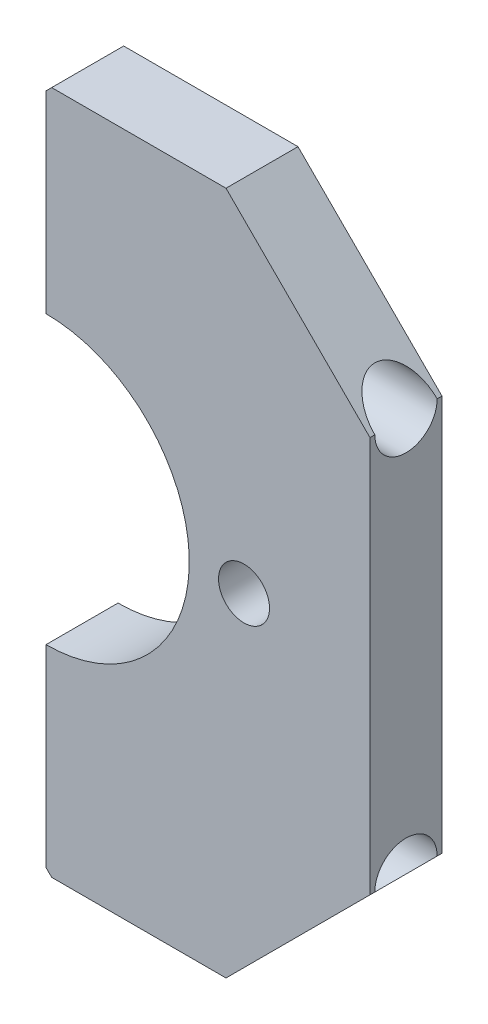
ISO-10303-21;
HEADER;
FILE_DESCRIPTION(('STEP AP214'),'2;1');
FILE_NAME('part.step','',(''),(''),'','','');
FILE_SCHEMA(('AUTOMOTIVE_DESIGN { 1 0 10303 214 1 1 1 1 }'));
ENDSEC;
DATA;
#1=APPLICATION_CONTEXT('core data for automotive mechanical design processes');
#2=APPLICATION_PROTOCOL_DEFINITION('international standard','automotive_design',2000,#1);
#3=PRODUCT_CONTEXT('',#1,'mechanical');
#4=PRODUCT('Part','Part','',(#3));
#5=PRODUCT_RELATED_PRODUCT_CATEGORY('part','',(#4));
#6=PRODUCT_DEFINITION_FORMATION('','',#4);
#7=PRODUCT_DEFINITION_CONTEXT('part definition',#1,'design');
#8=PRODUCT_DEFINITION('design','',#6,#7);
#9=PRODUCT_DEFINITION_SHAPE('','',#8);
#10=(LENGTH_UNIT() NAMED_UNIT(*) SI_UNIT(.MILLI.,.METRE.));
#11=(NAMED_UNIT(*) PLANE_ANGLE_UNIT() SI_UNIT($,.RADIAN.));
#12=(NAMED_UNIT(*) SI_UNIT($,.STERADIAN.) SOLID_ANGLE_UNIT());
#13=UNCERTAINTY_MEASURE_WITH_UNIT(LENGTH_MEASURE(1.E-05),#10,'distance_accuracy_value','');
#14=(GEOMETRIC_REPRESENTATION_CONTEXT(3) GLOBAL_UNCERTAINTY_ASSIGNED_CONTEXT((#13)) GLOBAL_UNIT_ASSIGNED_CONTEXT((#10,
#11,#12)) REPRESENTATION_CONTEXT('',''));
#15=CARTESIAN_POINT('',(0.,0.,0.));
#16=DIRECTION('',(0.,0.,1.));
#17=DIRECTION('',(1.,0.,0.));
#18=AXIS2_PLACEMENT_3D('',#15,#16,#17);
#19=CARTESIAN_POINT('',(57.15,-60.325,12.7));
#20=DIRECTION('',(-1.,0.,0.));
#21=DIRECTION('',(0.,0.,1.));
#22=AXIS2_PLACEMENT_3D('',#19,#20,#21);
#23=PLANE('',#22);
#24=DIRECTION('',(0.,0.,1.));
#25=VECTOR('',#24,1.);
#26=CARTESIAN_POINT('',(57.15,34.9249999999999,12.7));
#27=LINE('',#26,#25);
#28=CARTESIAN_POINT('',(57.15,34.9249999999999,0.));
#29=VERTEX_POINT('',#28);
#30=CARTESIAN_POINT('',(57.15,34.9249999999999,0.850899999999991));
#31=VERTEX_POINT('',#30);
#32=EDGE_CURVE('E139',#29,#31,#27,.T.);
#33=ORIENTED_EDGE('',*,*,#32,.T.);
#34=CARTESIAN_POINT('',(57.15,34.925,6.35));
#35=DIRECTION('',(1.,0.,0.));
#36=DIRECTION('',(0.,0.,-1.));
#37=AXIS2_PLACEMENT_3D('',#34,#35,#36);
#38=CIRCLE('',#37,5.49910000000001);
#39=CARTESIAN_POINT('',(57.15,34.9249999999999,11.8491));
#40=VERTEX_POINT('',#39);
#41=EDGE_CURVE('E126',#40,#31,#38,.T.);
#42=ORIENTED_EDGE('',*,*,#41,.F.);
#43=CARTESIAN_POINT('',(57.15,34.9249999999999,12.7));
#44=VERTEX_POINT('',#43);
#45=EDGE_CURVE('E136',#40,#44,#27,.T.);
#46=ORIENTED_EDGE('',*,*,#45,.T.);
#47=DIRECTION('',(0.,1.,0.));
#48=VECTOR('',#47,1.);
#49=CARTESIAN_POINT('',(57.15,-60.325,12.7));
#50=LINE('',#49,#48);
#51=CARTESIAN_POINT('',(57.15,-34.9250000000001,12.7));
#52=VERTEX_POINT('',#51);
#53=EDGE_CURVE('E196',#52,#44,#50,.T.);
#54=ORIENTED_EDGE('',*,*,#53,.F.);
#55=DIRECTION('',(0.,0.,-1.));
#56=VECTOR('',#55,1.);
#57=CARTESIAN_POINT('',(57.15,-34.925,12.7));
#58=LINE('',#57,#56);
#59=CARTESIAN_POINT('',(57.15,-34.925,11.8491));
#60=VERTEX_POINT('',#59);
#61=EDGE_CURVE('E146',#52,#60,#58,.T.);
#62=ORIENTED_EDGE('',*,*,#61,.T.);
#63=CARTESIAN_POINT('',(57.15,-34.925,6.35));
#64=DIRECTION('',(1.,0.,0.));
#65=DIRECTION('',(0.,0.,-1.));
#66=AXIS2_PLACEMENT_3D('',#63,#64,#65);
#67=CIRCLE('',#66,5.49910000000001);
#68=CARTESIAN_POINT('',(57.15,-34.925,0.85089999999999));
#69=VERTEX_POINT('',#68);
#70=EDGE_CURVE('E215',#69,#60,#67,.T.);
#71=ORIENTED_EDGE('',*,*,#70,.F.);
#72=CARTESIAN_POINT('',(57.15,-34.925,0.));
#73=VERTEX_POINT('',#72);
#74=EDGE_CURVE('E150',#69,#73,#58,.T.);
#75=ORIENTED_EDGE('',*,*,#74,.T.);
#76=DIRECTION('',(0.,1.,0.));
#77=VECTOR('',#76,1.);
#78=CARTESIAN_POINT('',(57.15,-60.325,0.));
#79=LINE('',#78,#77);
#80=EDGE_CURVE('E214',#73,#29,#79,.T.);
#81=ORIENTED_EDGE('',*,*,#80,.T.);
#82=EDGE_LOOP('',(#33,#42,#46,#54,#62,#71,#75,#81));
#83=FACE_BOUND('',#82,.T.);
#84=ADVANCED_FACE('F34',(#83),#23,.F.);
#85=CARTESIAN_POINT('',(0.,-60.325,12.7));
#86=DIRECTION('',(1.,0.,0.));
#87=DIRECTION('',(0.,0.,-1.));
#88=AXIS2_PLACEMENT_3D('',#85,#86,#87);
#89=PLANE('',#88);
#90=CARTESIAN_POINT('',(0.,34.925,6.35));
#91=DIRECTION('',(1.,0.,0.));
#92=DIRECTION('',(0.,0.,-1.));
#93=AXIS2_PLACEMENT_3D('',#90,#91,#92);
#94=CIRCLE('',#93,3.30200000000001);
#95=CARTESIAN_POINT('',(0.,34.925,3.04799999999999));
#96=VERTEX_POINT('',#95);
#97=EDGE_CURVE('E248',#96,#96,#94,.T.);
#98=ORIENTED_EDGE('',*,*,#97,.T.);
#99=EDGE_LOOP('',(#98));
#100=FACE_BOUND('',#99,.T.);
#101=DIRECTION('',(0.,-1.,0.));
#102=VECTOR('',#101,1.);
#103=CARTESIAN_POINT('',(0.,-60.325,12.7));
#104=LINE('',#103,#102);
#105=CARTESIAN_POINT('',(0.,59.325,12.7));
#106=VERTEX_POINT('',#105);
#107=CARTESIAN_POINT('',(0.,25.273,12.7));
#108=VERTEX_POINT('',#107);
#109=EDGE_CURVE('E183',#106,#108,#104,.T.);
#110=ORIENTED_EDGE('',*,*,#109,.F.);
#111=DIRECTION('',(0.,0.,-1.));
#112=VECTOR('',#111,1.);
#113=CARTESIAN_POINT('',(0.,59.325,12.7));
#114=LINE('',#113,#112);
#115=CARTESIAN_POINT('',(0.,59.325,0.));
#116=VERTEX_POINT('',#115);
#117=EDGE_CURVE('E42',#106,#116,#114,.T.);
#118=ORIENTED_EDGE('',*,*,#117,.T.);
#119=DIRECTION('',(0.,-1.,0.));
#120=VECTOR('',#119,1.);
#121=CARTESIAN_POINT('',(0.,-60.325,0.));
#122=LINE('',#121,#120);
#123=CARTESIAN_POINT('',(0.,25.273,0.));
#124=VERTEX_POINT('',#123);
#125=EDGE_CURVE('E181',#116,#124,#122,.T.);
#126=ORIENTED_EDGE('',*,*,#125,.T.);
#127=DIRECTION('',(0.,0.,1.));
#128=VECTOR('',#127,1.);
#129=CARTESIAN_POINT('',(0.,25.273,0.));
#130=LINE('',#129,#128);
#131=EDGE_CURVE('E162',#124,#108,#130,.T.);
#132=ORIENTED_EDGE('',*,*,#131,.T.);
#133=EDGE_LOOP('',(#110,#118,#126,#132));
#134=FACE_BOUND('',#133,.T.);
#135=ADVANCED_FACE('F180',(#100,#134),#89,.F.);
#136=CARTESIAN_POINT('',(57.15,60.325,12.7));
#137=DIRECTION('',(0.,0.,1.));
#138=DIRECTION('',(1.,0.,0.));
#139=AXIS2_PLACEMENT_3D('',#136,#137,#138);
#140=PLANE('',#139);
#141=CARTESIAN_POINT('',(0.,-25.273,12.7));
#142=VERTEX_POINT('',#141);
#143=CARTESIAN_POINT('',(0.,-59.325,12.7));
#144=VERTEX_POINT('',#143);
#145=EDGE_CURVE('E228',#142,#144,#104,.T.);
#146=ORIENTED_EDGE('',*,*,#145,.T.);
#147=DIRECTION('',(-0.707106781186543,0.707106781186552,0.));
#148=VECTOR('',#147,1.);
#149=CARTESIAN_POINT('',(-31.2500000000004,-28.0749999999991,12.7));
#150=LINE('',#149,#148);
#151=CARTESIAN_POINT('',(0.999999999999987,-60.325,12.7));
#152=VERTEX_POINT('',#151);
#153=EDGE_CURVE('E175',#144,#152,#150,.F.);
#154=ORIENTED_EDGE('',*,*,#153,.T.);
#155=DIRECTION('',(1.,0.,0.));
#156=VECTOR('',#155,1.);
#157=CARTESIAN_POINT('',(57.15,-60.325,12.7));
#158=LINE('',#157,#156);
#159=CARTESIAN_POINT('',(31.7499999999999,-60.325,12.7));
#160=VERTEX_POINT('',#159);
#161=EDGE_CURVE('E207',#152,#160,#158,.T.);
#162=ORIENTED_EDGE('',*,*,#161,.T.);
#163=DIRECTION('',(-0.707106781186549,-0.707106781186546,0.));
#164=VECTOR('',#163,1.);
#165=CARTESIAN_POINT('',(104.775,12.6999999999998,12.7));
#166=LINE('',#165,#164);
#167=EDGE_CURVE('E148',#160,#52,#166,.F.);
#168=ORIENTED_EDGE('',*,*,#167,.T.);
#169=ORIENTED_EDGE('',*,*,#53,.T.);
#170=DIRECTION('',(0.707106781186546,-0.707106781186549,0.));
#171=VECTOR('',#170,1.);
#172=CARTESIAN_POINT('',(44.45,47.625,12.7));
#173=LINE('',#172,#171);
#174=CARTESIAN_POINT('',(31.75,60.325,12.7));
#175=VERTEX_POINT('',#174);
#176=EDGE_CURVE('E145',#44,#175,#173,.F.);
#177=ORIENTED_EDGE('',*,*,#176,.T.);
#178=DIRECTION('',(-1.,0.,0.));
#179=VECTOR('',#178,1.);
#180=CARTESIAN_POINT('',(57.15,60.325,12.7));
#181=LINE('',#180,#179);
#182=CARTESIAN_POINT('',(0.999999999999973,60.325,12.7));
#183=VERTEX_POINT('',#182);
#184=EDGE_CURVE('E229',#175,#183,#181,.T.);
#185=ORIENTED_EDGE('',*,*,#184,.T.);
#186=DIRECTION('',(0.707106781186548,0.707106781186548,0.));
#187=VECTOR('',#186,1.);
#188=CARTESIAN_POINT('',(29.075,88.4,12.7));
#189=LINE('',#188,#187);
#190=EDGE_CURVE('E49',#183,#106,#189,.F.);
#191=ORIENTED_EDGE('',*,*,#190,.T.);
#192=ORIENTED_EDGE('',*,*,#109,.T.);
#193=CARTESIAN_POINT('',(0.,0.,12.7));
#194=DIRECTION('',(0.,0.,1.));
#195=DIRECTION('',(1.,0.,0.));
#196=AXIS2_PLACEMENT_3D('',#193,#194,#195);
#197=CIRCLE('',#196,25.273);
#198=EDGE_CURVE('E234',#142,#108,#197,.T.);
#199=ORIENTED_EDGE('',*,*,#198,.F.);
#200=EDGE_LOOP('',(#146,#154,#162,#168,#169,#177,#185,#191,#192,#199));
#201=FACE_BOUND('',#200,.T.);
#202=CARTESIAN_POINT('',(34.925,0.,12.7));
#203=DIRECTION('',(0.,0.,1.));
#204=DIRECTION('',(1.,0.,0.));
#205=AXIS2_PLACEMENT_3D('',#202,#203,#204);
#206=CIRCLE('',#205,4.4958);
#207=CARTESIAN_POINT('',(39.4208,0.,12.7));
#208=VERTEX_POINT('',#207);
#209=EDGE_CURVE('E221',#208,#208,#206,.T.);
#210=ORIENTED_EDGE('',*,*,#209,.F.);
#211=EDGE_LOOP('',(#210));
#212=FACE_BOUND('',#211,.T.);
#213=ADVANCED_FACE('F274',(#201,#212),#140,.T.);
#214=CARTESIAN_POINT('',(57.15,60.325,0.));
#215=DIRECTION('',(0.,0.,1.));
#216=DIRECTION('',(1.,0.,0.));
#217=AXIS2_PLACEMENT_3D('',#214,#215,#216);
#218=PLANE('',#217);
#219=DIRECTION('',(1.,0.,0.));
#220=VECTOR('',#219,1.);
#221=CARTESIAN_POINT('',(57.15,-60.325,0.));
#222=LINE('',#221,#220);
#223=CARTESIAN_POINT('',(0.999999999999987,-60.325,0.));
#224=VERTEX_POINT('',#223);
#225=CARTESIAN_POINT('',(31.7499999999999,-60.325,0.));
#226=VERTEX_POINT('',#225);
#227=EDGE_CURVE('E193',#224,#226,#222,.T.);
#228=ORIENTED_EDGE('',*,*,#227,.F.);
#229=DIRECTION('',(0.707106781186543,-0.707106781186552,0.));
#230=VECTOR('',#229,1.);
#231=CARTESIAN_POINT('',(0.999999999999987,-60.325,0.));
#232=LINE('',#231,#230);
#233=CARTESIAN_POINT('',(0.,-59.325,0.));
#234=VERTEX_POINT('',#233);
#235=EDGE_CURVE('E170',#224,#234,#232,.F.);
#236=ORIENTED_EDGE('',*,*,#235,.T.);
#237=CARTESIAN_POINT('',(0.,-25.273,0.));
#238=VERTEX_POINT('',#237);
#239=EDGE_CURVE('E194',#238,#234,#122,.T.);
#240=ORIENTED_EDGE('',*,*,#239,.F.);
#241=CARTESIAN_POINT('',(0.,0.,0.));
#242=DIRECTION('',(0.,0.,1.));
#243=DIRECTION('',(1.,0.,0.));
#244=AXIS2_PLACEMENT_3D('',#241,#242,#243);
#245=CIRCLE('',#244,25.273);
#246=EDGE_CURVE('E192',#238,#124,#245,.T.);
#247=ORIENTED_EDGE('',*,*,#246,.T.);
#248=ORIENTED_EDGE('',*,*,#125,.F.);
#249=DIRECTION('',(-0.707106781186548,-0.707106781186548,0.));
#250=VECTOR('',#249,1.);
#251=CARTESIAN_POINT('',(0.,59.325,0.));
#252=LINE('',#251,#250);
#253=CARTESIAN_POINT('',(0.999999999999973,60.325,0.));
#254=VERTEX_POINT('',#253);
#255=EDGE_CURVE('E168',#116,#254,#252,.F.);
#256=ORIENTED_EDGE('',*,*,#255,.T.);
#257=DIRECTION('',(-1.,0.,0.));
#258=VECTOR('',#257,1.);
#259=CARTESIAN_POINT('',(57.15,60.325,0.));
#260=LINE('',#259,#258);
#261=CARTESIAN_POINT('',(31.75,60.325,0.));
#262=VERTEX_POINT('',#261);
#263=EDGE_CURVE('E199',#262,#254,#260,.T.);
#264=ORIENTED_EDGE('',*,*,#263,.F.);
#265=DIRECTION('',(-0.707106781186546,0.707106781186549,0.));
#266=VECTOR('',#265,1.);
#267=CARTESIAN_POINT('',(31.75,60.325,0.));
#268=LINE('',#267,#266);
#269=EDGE_CURVE('E209',#262,#29,#268,.F.);
#270=ORIENTED_EDGE('',*,*,#269,.T.);
#271=ORIENTED_EDGE('',*,*,#80,.F.);
#272=DIRECTION('',(0.707106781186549,0.707106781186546,0.));
#273=VECTOR('',#272,1.);
#274=CARTESIAN_POINT('',(57.15,-34.925,0.));
#275=LINE('',#274,#273);
#276=EDGE_CURVE('E206',#73,#226,#275,.F.);
#277=ORIENTED_EDGE('',*,*,#276,.T.);
#278=EDGE_LOOP('',(#228,#236,#240,#247,#248,#256,#264,#270,#271,#277));
#279=FACE_BOUND('',#278,.T.);
#280=CARTESIAN_POINT('',(34.925,0.,0.));
#281=DIRECTION('',(0.,0.,1.));
#282=DIRECTION('',(1.,0.,0.));
#283=AXIS2_PLACEMENT_3D('',#280,#281,#282);
#284=CIRCLE('',#283,4.4958);
#285=CARTESIAN_POINT('',(39.4208,0.,0.));
#286=VERTEX_POINT('',#285);
#287=EDGE_CURVE('E223',#286,#286,#284,.T.);
#288=ORIENTED_EDGE('',*,*,#287,.T.);
#289=EDGE_LOOP('',(#288));
#290=FACE_BOUND('',#289,.T.);
#291=ADVANCED_FACE('F188',(#279,#290),#218,.F.);
#292=CARTESIAN_POINT('',(57.15,60.325,12.7));
#293=DIRECTION('',(0.,-1.,0.));
#294=DIRECTION('',(1.,0.,0.));
#295=AXIS2_PLACEMENT_3D('',#292,#293,#294);
#296=PLANE('',#295);
#297=ORIENTED_EDGE('',*,*,#263,.T.);
#298=DIRECTION('',(0.,0.,1.));
#299=VECTOR('',#298,1.);
#300=CARTESIAN_POINT('',(0.999999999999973,60.325,12.7));
#301=LINE('',#300,#299);
#302=EDGE_CURVE('E11',#254,#183,#301,.T.);
#303=ORIENTED_EDGE('',*,*,#302,.T.);
#304=ORIENTED_EDGE('',*,*,#184,.F.);
#305=DIRECTION('',(0.,0.,-1.));
#306=VECTOR('',#305,1.);
#307=CARTESIAN_POINT('',(31.75,60.325,12.7));
#308=LINE('',#307,#306);
#309=EDGE_CURVE('E203',#175,#262,#308,.T.);
#310=ORIENTED_EDGE('',*,*,#309,.T.);
#311=EDGE_LOOP('',(#297,#303,#304,#310));
#312=FACE_BOUND('',#311,.T.);
#313=ADVANCED_FACE('F280',(#312),#296,.F.);
#314=CARTESIAN_POINT('',(0.,-34.925,6.35));
#315=DIRECTION('',(1.,0.,0.));
#316=DIRECTION('',(0.,0.,-1.));
#317=AXIS2_PLACEMENT_3D('',#314,#315,#316);
#318=CIRCLE('',#317,3.30200000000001);
#319=CARTESIAN_POINT('',(0.,-34.925,3.04799999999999));
#320=VERTEX_POINT('',#319);
#321=EDGE_CURVE('E237',#320,#320,#318,.T.);
#322=ORIENTED_EDGE('',*,*,#321,.T.);
#323=EDGE_LOOP('',(#322));
#324=FACE_BOUND('',#323,.T.);
#325=ORIENTED_EDGE('',*,*,#239,.T.);
#326=DIRECTION('',(0.,0.,1.));
#327=VECTOR('',#326,1.);
#328=CARTESIAN_POINT('',(0.,-59.325,12.7));
#329=LINE('',#328,#327);
#330=EDGE_CURVE('E172',#234,#144,#329,.T.);
#331=ORIENTED_EDGE('',*,*,#330,.T.);
#332=ORIENTED_EDGE('',*,*,#145,.F.);
#333=DIRECTION('',(0.,0.,1.));
#334=VECTOR('',#333,1.);
#335=CARTESIAN_POINT('',(0.,-25.273,0.));
#336=LINE('',#335,#334);
#337=EDGE_CURVE('E159',#142,#238,#336,.F.);
#338=ORIENTED_EDGE('',*,*,#337,.T.);
#339=EDGE_LOOP('',(#325,#331,#332,#338));
#340=FACE_BOUND('',#339,.T.);
#341=ADVANCED_FACE('F277',(#324,#340),#89,.F.);
#342=CARTESIAN_POINT('',(57.15,-60.325,12.7));
#343=DIRECTION('',(0.,1.,0.));
#344=DIRECTION('',(-1.,0.,0.));
#345=AXIS2_PLACEMENT_3D('',#342,#343,#344);
#346=PLANE('',#345);
#347=ORIENTED_EDGE('',*,*,#161,.F.);
#348=DIRECTION('',(0.,0.,-1.));
#349=VECTOR('',#348,1.);
#350=CARTESIAN_POINT('',(0.999999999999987,-60.325,12.7));
#351=LINE('',#350,#349);
#352=EDGE_CURVE('E131',#152,#224,#351,.T.);
#353=ORIENTED_EDGE('',*,*,#352,.T.);
#354=ORIENTED_EDGE('',*,*,#227,.T.);
#355=DIRECTION('',(0.,0.,1.));
#356=VECTOR('',#355,1.);
#357=CARTESIAN_POINT('',(31.7499999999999,-60.325,12.7));
#358=LINE('',#357,#356);
#359=EDGE_CURVE('E156',#226,#160,#358,.T.);
#360=ORIENTED_EDGE('',*,*,#359,.T.);
#361=EDGE_LOOP('',(#347,#353,#354,#360));
#362=FACE_BOUND('',#361,.T.);
#363=ADVANCED_FACE('F302',(#362),#346,.F.);
#364=CARTESIAN_POINT('',(34.925,0.,12.7));
#365=DIRECTION('',(0.,0.,-1.));
#366=DIRECTION('',(-1.,0.,0.));
#367=AXIS2_PLACEMENT_3D('',#364,#365,#366);
#368=CYLINDRICAL_SURFACE('',#367,4.4958);
#369=ORIENTED_EDGE('',*,*,#209,.T.);
#370=EDGE_LOOP('',(#369));
#371=FACE_BOUND('',#370,.T.);
#372=ORIENTED_EDGE('',*,*,#287,.F.);
#373=EDGE_LOOP('',(#372));
#374=FACE_BOUND('',#373,.T.);
#375=ADVANCED_FACE('F283',(#371,#374),#368,.F.);
#376=CARTESIAN_POINT('',(31.75,60.325,12.7));
#377=DIRECTION('',(-0.707106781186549,-0.707106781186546,0.));
#378=DIRECTION('',(0.707106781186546,-0.707106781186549,0.));
#379=AXIS2_PLACEMENT_3D('',#376,#377,#378);
#380=PLANE('',#379);
#381=CARTESIAN_POINT('',(57.1499999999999,34.925,6.35));
#382=DIRECTION('',(-0.707106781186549,-0.707106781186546,0.));
#383=DIRECTION('',(0.707106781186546,-0.707106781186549,0.));
#384=AXIS2_PLACEMENT_3D('',#381,#382,#383);
#385=ELLIPSE('',#384,7.77690180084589,5.49910000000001);
#386=EDGE_CURVE('E122',#31,#40,#385,.F.);
#387=ORIENTED_EDGE('',*,*,#386,.F.);
#388=ORIENTED_EDGE('',*,*,#32,.F.);
#389=ORIENTED_EDGE('',*,*,#269,.F.);
#390=ORIENTED_EDGE('',*,*,#309,.F.);
#391=ORIENTED_EDGE('',*,*,#176,.F.);
#392=ORIENTED_EDGE('',*,*,#45,.F.);
#393=EDGE_LOOP('',(#387,#388,#389,#390,#391,#392));
#394=FACE_BOUND('',#393,.T.);
#395=ADVANCED_FACE('F143',(#394),#380,.F.);
#396=CARTESIAN_POINT('',(57.15,-34.925,12.7));
#397=DIRECTION('',(-0.707106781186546,0.707106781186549,0.));
#398=DIRECTION('',(-0.707106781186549,-0.707106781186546,0.));
#399=AXIS2_PLACEMENT_3D('',#396,#397,#398);
#400=PLANE('',#399);
#401=CARTESIAN_POINT('',(57.15,-34.925,6.35));
#402=DIRECTION('',(-0.707106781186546,0.707106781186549,0.));
#403=DIRECTION('',(0.707106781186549,0.707106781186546,0.));
#404=AXIS2_PLACEMENT_3D('',#401,#402,#403);
#405=ELLIPSE('',#404,7.77690180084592,5.49910000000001);
#406=EDGE_CURVE('E132',#60,#69,#405,.F.);
#407=ORIENTED_EDGE('',*,*,#406,.F.);
#408=ORIENTED_EDGE('',*,*,#61,.F.);
#409=ORIENTED_EDGE('',*,*,#167,.F.);
#410=ORIENTED_EDGE('',*,*,#359,.F.);
#411=ORIENTED_EDGE('',*,*,#276,.F.);
#412=ORIENTED_EDGE('',*,*,#74,.F.);
#413=EDGE_LOOP('',(#407,#408,#409,#410,#411,#412));
#414=FACE_BOUND('',#413,.T.);
#415=ADVANCED_FACE('F219',(#414),#400,.F.);
#416=CARTESIAN_POINT('',(0.,0.,0.));
#417=DIRECTION('',(0.,0.,1.));
#418=DIRECTION('',(1.,0.,0.));
#419=AXIS2_PLACEMENT_3D('',#416,#417,#418);
#420=CYLINDRICAL_SURFACE('',#419,25.273);
#421=ORIENTED_EDGE('',*,*,#246,.F.);
#422=ORIENTED_EDGE('',*,*,#337,.F.);
#423=ORIENTED_EDGE('',*,*,#198,.T.);
#424=ORIENTED_EDGE('',*,*,#131,.F.);
#425=EDGE_LOOP('',(#421,#422,#423,#424));
#426=FACE_BOUND('',#425,.T.);
#427=ADVANCED_FACE('F285',(#426),#420,.F.);
#428=CARTESIAN_POINT('',(57.15,-34.925,6.35));
#429=DIRECTION('',(1.,0.,0.));
#430=DIRECTION('',(0.,0.,-1.));
#431=AXIS2_PLACEMENT_3D('',#428,#429,#430);
#432=CYLINDRICAL_SURFACE('',#431,3.30200000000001);
#433=ORIENTED_EDGE('',*,*,#321,.F.);
#434=EDGE_LOOP('',(#433));
#435=FACE_BOUND('',#434,.T.);
#436=CARTESIAN_POINT('',(30.226,-34.925,6.35));
#437=DIRECTION('',(1.,0.,0.));
#438=DIRECTION('',(0.,0.,-1.));
#439=AXIS2_PLACEMENT_3D('',#436,#437,#438);
#440=CIRCLE('',#439,3.30200000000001);
#441=CARTESIAN_POINT('',(30.226,-34.925,3.04799999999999));
#442=VERTEX_POINT('',#441);
#443=EDGE_CURVE('E241',#442,#442,#440,.T.);
#444=ORIENTED_EDGE('',*,*,#443,.T.);
#445=EDGE_LOOP('',(#444));
#446=FACE_BOUND('',#445,.T.);
#447=ADVANCED_FACE('F289',(#435,#446),#432,.F.);
#448=CARTESIAN_POINT('',(30.226,-31.623,6.35));
#449=DIRECTION('',(-1.,0.,0.));
#450=DIRECTION('',(0.,0.,1.));
#451=AXIS2_PLACEMENT_3D('',#448,#449,#450);
#452=PLANE('',#451);
#453=ORIENTED_EDGE('',*,*,#443,.F.);
#454=EDGE_LOOP('',(#453));
#455=FACE_BOUND('',#454,.T.);
#456=CARTESIAN_POINT('',(30.226,-34.925,6.35));
#457=DIRECTION('',(1.,0.,0.));
#458=DIRECTION('',(0.,0.,-1.));
#459=AXIS2_PLACEMENT_3D('',#456,#457,#458);
#460=CIRCLE('',#459,5.49910000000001);
#461=CARTESIAN_POINT('',(30.226,-34.925,0.85089999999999));
#462=VERTEX_POINT('',#461);
#463=EDGE_CURVE('E244',#462,#462,#460,.T.);
#464=ORIENTED_EDGE('',*,*,#463,.T.);
#465=EDGE_LOOP('',(#464));
#466=FACE_BOUND('',#465,.T.);
#467=ADVANCED_FACE('F295',(#455,#466),#452,.F.);
#468=CARTESIAN_POINT('',(57.15,-34.925,6.35));
#469=DIRECTION('',(1.,0.,0.));
#470=DIRECTION('',(0.,0.,-1.));
#471=AXIS2_PLACEMENT_3D('',#468,#469,#470);
#472=CYLINDRICAL_SURFACE('',#471,5.49910000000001);
#473=ORIENTED_EDGE('',*,*,#406,.T.);
#474=ORIENTED_EDGE('',*,*,#70,.T.);
#475=EDGE_LOOP('',(#473,#474));
#476=FACE_BOUND('',#475,.T.);
#477=ORIENTED_EDGE('',*,*,#463,.F.);
#478=EDGE_LOOP('',(#477));
#479=FACE_BOUND('',#478,.T.);
#480=ADVANCED_FACE('F389',(#476,#479),#472,.F.);
#481=CARTESIAN_POINT('',(57.15,34.925,6.35));
#482=DIRECTION('',(1.,0.,0.));
#483=DIRECTION('',(0.,0.,-1.));
#484=AXIS2_PLACEMENT_3D('',#481,#482,#483);
#485=CYLINDRICAL_SURFACE('',#484,3.30200000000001);
#486=ORIENTED_EDGE('',*,*,#97,.F.);
#487=EDGE_LOOP('',(#486));
#488=FACE_BOUND('',#487,.T.);
#489=CARTESIAN_POINT('',(30.226,34.925,6.35));
#490=DIRECTION('',(1.,0.,0.));
#491=DIRECTION('',(0.,0.,-1.));
#492=AXIS2_PLACEMENT_3D('',#489,#490,#491);
#493=CIRCLE('',#492,3.30200000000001);
#494=CARTESIAN_POINT('',(30.226,34.925,3.04799999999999));
#495=VERTEX_POINT('',#494);
#496=EDGE_CURVE('E251',#495,#495,#493,.T.);
#497=ORIENTED_EDGE('',*,*,#496,.T.);
#498=EDGE_LOOP('',(#497));
#499=FACE_BOUND('',#498,.T.);
#500=ADVANCED_FACE('F266',(#488,#499),#485,.F.);
#501=CARTESIAN_POINT('',(30.226,38.227,6.35));
#502=DIRECTION('',(-1.,0.,0.));
#503=DIRECTION('',(0.,0.,1.));
#504=AXIS2_PLACEMENT_3D('',#501,#502,#503);
#505=PLANE('',#504);
#506=ORIENTED_EDGE('',*,*,#496,.F.);
#507=EDGE_LOOP('',(#506));
#508=FACE_BOUND('',#507,.T.);
#509=CARTESIAN_POINT('',(30.226,34.925,6.35));
#510=DIRECTION('',(1.,0.,0.));
#511=DIRECTION('',(0.,0.,-1.));
#512=AXIS2_PLACEMENT_3D('',#509,#510,#511);
#513=CIRCLE('',#512,5.49910000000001);
#514=CARTESIAN_POINT('',(30.226,34.925,0.850899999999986));
#515=VERTEX_POINT('',#514);
#516=EDGE_CURVE('E140',#515,#515,#513,.T.);
#517=ORIENTED_EDGE('',*,*,#516,.T.);
#518=EDGE_LOOP('',(#517));
#519=FACE_BOUND('',#518,.T.);
#520=ADVANCED_FACE('F257',(#508,#519),#505,.F.);
#521=CARTESIAN_POINT('',(57.15,34.925,6.35));
#522=DIRECTION('',(1.,0.,0.));
#523=DIRECTION('',(0.,0.,-1.));
#524=AXIS2_PLACEMENT_3D('',#521,#522,#523);
#525=CYLINDRICAL_SURFACE('',#524,5.49910000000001);
#526=ORIENTED_EDGE('',*,*,#386,.T.);
#527=ORIENTED_EDGE('',*,*,#41,.T.);
#528=EDGE_LOOP('',(#526,#527));
#529=FACE_BOUND('',#528,.T.);
#530=ORIENTED_EDGE('',*,*,#516,.F.);
#531=EDGE_LOOP('',(#530));
#532=FACE_BOUND('',#531,.T.);
#533=ADVANCED_FACE('F124',(#529,#532),#525,.F.);
#534=CARTESIAN_POINT('',(0.999999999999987,-60.325,12.7));
#535=DIRECTION('',(0.707106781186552,0.707106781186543,0.));
#536=DIRECTION('',(0.,0.,-1.));
#537=AXIS2_PLACEMENT_3D('',#534,#535,#536);
#538=PLANE('',#537);
#539=ORIENTED_EDGE('',*,*,#153,.F.);
#540=ORIENTED_EDGE('',*,*,#330,.F.);
#541=ORIENTED_EDGE('',*,*,#235,.F.);
#542=ORIENTED_EDGE('',*,*,#352,.F.);
#543=EDGE_LOOP('',(#539,#540,#541,#542));
#544=FACE_BOUND('',#543,.T.);
#545=ADVANCED_FACE('F259',(#544),#538,.F.);
#546=CARTESIAN_POINT('',(0.,59.325,12.7));
#547=DIRECTION('',(0.707106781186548,-0.707106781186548,0.));
#548=DIRECTION('',(0.,0.,-1.));
#549=AXIS2_PLACEMENT_3D('',#546,#547,#548);
#550=PLANE('',#549);
#551=ORIENTED_EDGE('',*,*,#190,.F.);
#552=ORIENTED_EDGE('',*,*,#302,.F.);
#553=ORIENTED_EDGE('',*,*,#255,.F.);
#554=ORIENTED_EDGE('',*,*,#117,.F.);
#555=EDGE_LOOP('',(#551,#552,#553,#554));
#556=FACE_BOUND('',#555,.T.);
#557=ADVANCED_FACE('F36',(#556),#550,.F.);
#558=CLOSED_SHELL('',(#84,#135,#213,#291,#313,#341,#363,#375,#395,#415,#427,#447,#467,#480,#500,
#520,#533,#545,#557));
#559=MANIFOLD_SOLID_BREP('B2',#558);
#560=ADVANCED_BREP_SHAPE_REPRESENTATION('',(#18,#559),#14);
#561=SHAPE_DEFINITION_REPRESENTATION(#9,#560);
ENDSEC;
END-ISO-10303-21;
